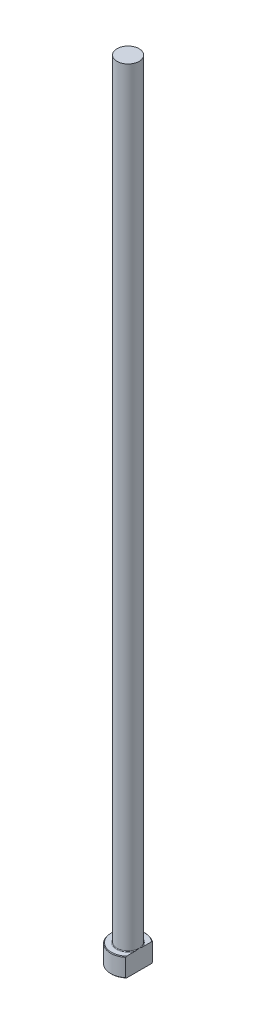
from build123d import *
from build123d.topology import SkipClean

# Parameters (mm, degrees)
CHAMFER1_SIZE    = 0.2
FILLET1_R        = 0.2
KEYED_HEAD_DEPTH = 251.120970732


with BuildPart() as part:
    # Sketch1 → Revolve1 (revolve)
    with BuildSketch(Plane.XY, mode=Mode.PRIVATE) as revolve1_sk:
        Polygon((0, 0), (-5.5, 0), (-5.5, 6), (-3.5, 6), (-3.5, 250), (0, 250), align=None)
    revolve(revolve1_sk.sketch.rotate(Axis((0, 259.958771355, 0), (0, -1, 0)), 270), axis=Axis((0, 259.958771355, 0), (0, -1, 0)))

    # Chamfer1
    chamfer1_edges = [part.edges().sort_by_distance(p)[0] for p in [
        (0, 6, -5.5),
        (0, 0, -5.5),
    ]]
    chamfer(chamfer1_edges, length=CHAMFER1_SIZE)

    # Fillet1
    fillet1_edges = [part.edges().sort_by_distance(p)[0] for p in [
        (0, 6, -3.5),
    ]]
    fillet(fillet1_edges, radius=FILLET1_R)

    # Sketch2 → KEYED HEAD (cut, through all)
    with SkipClean():  # the faces are left unmerged after this step: merging them gives an invalid solid
        with BuildSketch(Plane(origin=(0, 0, 0), x_dir=(1, 0, 0), z_dir=(0, 1, 0))):
            with BuildLine():
                Line((3.5, -4.242640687), (3.5, 4.242640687))
                ThreePointArc((3.5, 4.242640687), (5.5, 0), (3.5, -4.242640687))
            make_face()
        extrude(amount=KEYED_HEAD_DEPTH, mode=Mode.SUBTRACT)


solid = part.part
